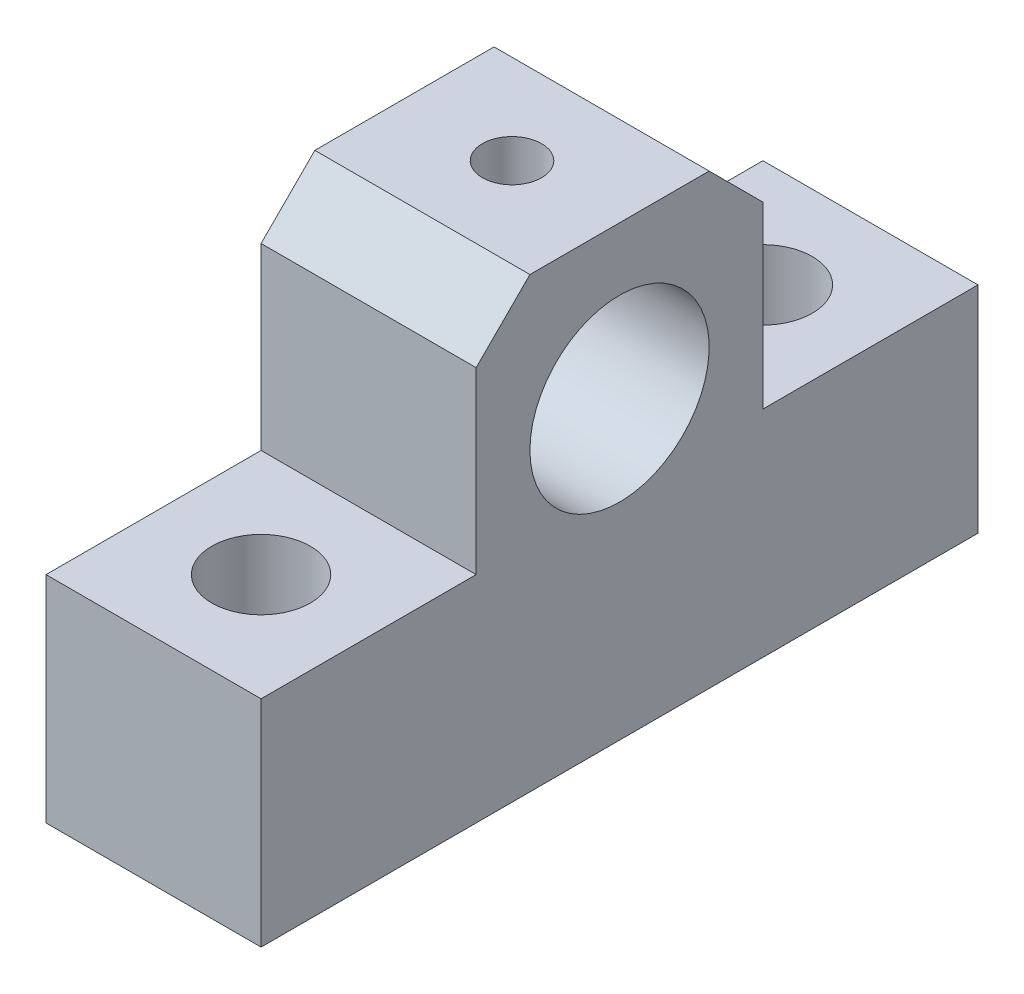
ISO-10303-21;
HEADER;
FILE_DESCRIPTION(('STEP AP214'),'2;1');
FILE_NAME('part.step','',(''),(''),'','','');
FILE_SCHEMA(('AUTOMOTIVE_DESIGN { 1 0 10303 214 1 1 1 1 }'));
ENDSEC;
DATA;
#1=APPLICATION_CONTEXT('core data for automotive mechanical design processes');
#2=APPLICATION_PROTOCOL_DEFINITION('international standard','automotive_design',2000,#1);
#3=PRODUCT_CONTEXT('',#1,'mechanical');
#4=PRODUCT('Part','Part','',(#3));
#5=PRODUCT_RELATED_PRODUCT_CATEGORY('part','',(#4));
#6=PRODUCT_DEFINITION_FORMATION('','',#4);
#7=PRODUCT_DEFINITION_CONTEXT('part definition',#1,'design');
#8=PRODUCT_DEFINITION('design','',#6,#7);
#9=PRODUCT_DEFINITION_SHAPE('','',#8);
#10=(LENGTH_UNIT() NAMED_UNIT(*) SI_UNIT(.MILLI.,.METRE.));
#11=(NAMED_UNIT(*) PLANE_ANGLE_UNIT() SI_UNIT($,.RADIAN.));
#12=(NAMED_UNIT(*) SI_UNIT($,.STERADIAN.) SOLID_ANGLE_UNIT());
#13=UNCERTAINTY_MEASURE_WITH_UNIT(LENGTH_MEASURE(1.E-05),#10,'distance_accuracy_value','');
#14=(GEOMETRIC_REPRESENTATION_CONTEXT(3) GLOBAL_UNCERTAINTY_ASSIGNED_CONTEXT((#13)) GLOBAL_UNIT_ASSIGNED_CONTEXT((#10,
#11,#12)) REPRESENTATION_CONTEXT('',''));
#15=CARTESIAN_POINT('',(0.,0.,0.));
#16=DIRECTION('',(0.,0.,1.));
#17=DIRECTION('',(1.,0.,0.));
#18=AXIS2_PLACEMENT_3D('',#15,#16,#17);
#19=CARTESIAN_POINT('',(6.,-12.5,14.));
#20=DIRECTION('',(0.,1.,0.));
#21=DIRECTION('',(0.,0.,1.));
#22=AXIS2_PLACEMENT_3D('',#19,#20,#21);
#23=CYLINDRICAL_SURFACE('',#22,2.75);
#24=CARTESIAN_POINT('',(6.,-12.5,14.));
#25=DIRECTION('',(0.,1.,0.));
#26=DIRECTION('',(0.,0.,1.));
#27=AXIS2_PLACEMENT_3D('',#24,#25,#26);
#28=CIRCLE('',#27,2.75);
#29=CARTESIAN_POINT('',(6.,-12.5,16.75));
#30=VERTEX_POINT('',#29);
#31=EDGE_CURVE('E239',#30,#30,#28,.F.);
#32=ORIENTED_EDGE('',*,*,#31,.T.);
#33=EDGE_LOOP('',(#32));
#34=FACE_BOUND('',#33,.T.);
#35=CARTESIAN_POINT('',(6.,-0.499999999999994,14.));
#36=DIRECTION('',(0.,1.,0.));
#37=DIRECTION('',(0.,0.,1.));
#38=AXIS2_PLACEMENT_3D('',#35,#36,#37);
#39=CIRCLE('',#38,2.75);
#40=CARTESIAN_POINT('',(6.,-0.499999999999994,16.75));
#41=VERTEX_POINT('',#40);
#42=EDGE_CURVE('E246',#41,#41,#39,.T.);
#43=ORIENTED_EDGE('',*,*,#42,.T.);
#44=EDGE_LOOP('',(#43));
#45=FACE_BOUND('',#44,.T.);
#46=ADVANCED_FACE('F17',(#34,#45),#23,.F.);
#47=CARTESIAN_POINT('',(6.,-12.5,-14.));
#48=DIRECTION('',(0.,1.,0.));
#49=DIRECTION('',(0.,0.,1.));
#50=AXIS2_PLACEMENT_3D('',#47,#48,#49);
#51=CYLINDRICAL_SURFACE('',#50,2.75);
#52=CARTESIAN_POINT('',(6.,-12.5,-14.));
#53=DIRECTION('',(0.,1.,0.));
#54=DIRECTION('',(0.,0.,1.));
#55=AXIS2_PLACEMENT_3D('',#52,#53,#54);
#56=CIRCLE('',#55,2.75);
#57=CARTESIAN_POINT('',(6.,-12.5,-11.25));
#58=VERTEX_POINT('',#57);
#59=EDGE_CURVE('E236',#58,#58,#56,.F.);
#60=ORIENTED_EDGE('',*,*,#59,.T.);
#61=EDGE_LOOP('',(#60));
#62=FACE_BOUND('',#61,.T.);
#63=CARTESIAN_POINT('',(6.,-0.49999999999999,-14.));
#64=DIRECTION('',(0.,1.,0.));
#65=DIRECTION('',(0.,0.,1.));
#66=AXIS2_PLACEMENT_3D('',#63,#64,#65);
#67=CIRCLE('',#66,2.75);
#68=CARTESIAN_POINT('',(6.,-0.49999999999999,-11.25));
#69=VERTEX_POINT('',#68);
#70=EDGE_CURVE('E225',#69,#69,#67,.T.);
#71=ORIENTED_EDGE('',*,*,#70,.T.);
#72=EDGE_LOOP('',(#71));
#73=FACE_BOUND('',#72,.T.);
#74=ADVANCED_FACE('F259',(#62,#73),#51,.F.);
#75=CARTESIAN_POINT('',(0.,0.,0.));
#76=DIRECTION('',(1.,0.,0.));
#77=DIRECTION('',(0.,0.,-1.));
#78=AXIS2_PLACEMENT_3D('',#75,#76,#77);
#79=PLANE('',#78);
#80=CARTESIAN_POINT('',(0.,3.99999999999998,0.));
#81=DIRECTION('',(-1.,0.,0.));
#82=DIRECTION('',(0.,0.,1.));
#83=AXIS2_PLACEMENT_3D('',#80,#81,#82);
#84=CIRCLE('',#83,5.);
#85=CARTESIAN_POINT('',(0.,3.99999999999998,5.));
#86=VERTEX_POINT('',#85);
#87=EDGE_CURVE('E127',#86,#86,#84,.F.);
#88=ORIENTED_EDGE('',*,*,#87,.T.);
#89=EDGE_LOOP('',(#88));
#90=FACE_BOUND('',#89,.T.);
#91=DIRECTION('',(0.,0.707106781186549,-0.707106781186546));
#92=VECTOR('',#91,1.);
#93=CARTESIAN_POINT('',(0.,12.5,4.99999999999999));
#94=LINE('',#93,#92);
#95=CARTESIAN_POINT('',(0.,9.49999999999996,8.));
#96=VERTEX_POINT('',#95);
#97=CARTESIAN_POINT('',(0.,12.5,4.99999999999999));
#98=VERTEX_POINT('',#97);
#99=EDGE_CURVE('E107',#96,#98,#94,.T.);
#100=ORIENTED_EDGE('',*,*,#99,.T.);
#101=DIRECTION('',(0.,0.,-1.));
#102=VECTOR('',#101,1.);
#103=CARTESIAN_POINT('',(0.,12.5,20.));
#104=LINE('',#103,#102);
#105=CARTESIAN_POINT('',(0.,12.5,-4.99999999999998));
#106=VERTEX_POINT('',#105);
#107=EDGE_CURVE('E96',#98,#106,#104,.T.);
#108=ORIENTED_EDGE('',*,*,#107,.T.);
#109=DIRECTION('',(0.,-0.707106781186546,-0.707106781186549));
#110=VECTOR('',#109,1.);
#111=CARTESIAN_POINT('',(0.,9.49999999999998,-8.00000000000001));
#112=LINE('',#111,#110);
#113=CARTESIAN_POINT('',(0.,9.49999999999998,-8.00000000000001));
#114=VERTEX_POINT('',#113);
#115=EDGE_CURVE('E212',#106,#114,#112,.T.);
#116=ORIENTED_EDGE('',*,*,#115,.T.);
#117=DIRECTION('',(0.,1.,0.));
#118=VECTOR('',#117,1.);
#119=CARTESIAN_POINT('',(0.,12.5,-8.00000000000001));
#120=LINE('',#119,#118);
#121=CARTESIAN_POINT('',(0.,-0.499999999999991,-8.00000000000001));
#122=VERTEX_POINT('',#121);
#123=EDGE_CURVE('E216',#114,#122,#120,.F.);
#124=ORIENTED_EDGE('',*,*,#123,.T.);
#125=DIRECTION('',(0.,0.,-1.));
#126=VECTOR('',#125,1.);
#127=CARTESIAN_POINT('',(0.,-0.499999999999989,-20.));
#128=LINE('',#127,#126);
#129=CARTESIAN_POINT('',(0.,-0.49999999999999,-20.));
#130=VERTEX_POINT('',#129);
#131=EDGE_CURVE('E223',#122,#130,#128,.T.);
#132=ORIENTED_EDGE('',*,*,#131,.T.);
#133=DIRECTION('',(0.,-1.,0.));
#134=VECTOR('',#133,1.);
#135=CARTESIAN_POINT('',(0.,12.5,-20.));
#136=LINE('',#135,#134);
#137=CARTESIAN_POINT('',(0.,-12.5,-20.));
#138=VERTEX_POINT('',#137);
#139=EDGE_CURVE('E226',#130,#138,#136,.T.);
#140=ORIENTED_EDGE('',*,*,#139,.T.);
#141=DIRECTION('',(0.,0.,1.));
#142=VECTOR('',#141,1.);
#143=CARTESIAN_POINT('',(0.,-12.5,20.));
#144=LINE('',#143,#142);
#145=CARTESIAN_POINT('',(0.,-12.5,20.));
#146=VERTEX_POINT('',#145);
#147=EDGE_CURVE('E231',#138,#146,#144,.T.);
#148=ORIENTED_EDGE('',*,*,#147,.T.);
#149=DIRECTION('',(0.,1.,0.));
#150=VECTOR('',#149,1.);
#151=CARTESIAN_POINT('',(0.,12.5,20.));
#152=LINE('',#151,#150);
#153=CARTESIAN_POINT('',(0.,-0.499999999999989,20.));
#154=VERTEX_POINT('',#153);
#155=EDGE_CURVE('E240',#146,#154,#152,.T.);
#156=ORIENTED_EDGE('',*,*,#155,.T.);
#157=DIRECTION('',(0.,0.,-1.));
#158=VECTOR('',#157,1.);
#159=CARTESIAN_POINT('',(0.,-0.49999999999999,20.));
#160=LINE('',#159,#158);
#161=CARTESIAN_POINT('',(0.,-0.49999999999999,8.));
#162=VERTEX_POINT('',#161);
#163=EDGE_CURVE('E244',#154,#162,#160,.T.);
#164=ORIENTED_EDGE('',*,*,#163,.T.);
#165=DIRECTION('',(0.,1.,0.));
#166=VECTOR('',#165,1.);
#167=CARTESIAN_POINT('',(0.,12.5,8.));
#168=LINE('',#167,#166);
#169=EDGE_CURVE('E91',#162,#96,#168,.T.);
#170=ORIENTED_EDGE('',*,*,#169,.T.);
#171=EDGE_LOOP('',(#100,#108,#116,#124,#132,#140,#148,#156,#164,#170));
#172=FACE_BOUND('',#171,.T.);
#173=ADVANCED_FACE('F108',(#90,#172),#79,.F.);
#174=CARTESIAN_POINT('',(6.,12.5,0.));
#175=DIRECTION('',(0.,1.,0.));
#176=DIRECTION('',(0.,0.,1.));
#177=AXIS2_PLACEMENT_3D('',#174,#175,#176);
#178=CYLINDRICAL_SURFACE('',#177,1.64999999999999);
#179=CARTESIAN_POINT('',(6.,12.5,0.));
#180=DIRECTION('',(0.,1.,0.));
#181=DIRECTION('',(0.,0.,1.));
#182=AXIS2_PLACEMENT_3D('',#179,#180,#181);
#183=CIRCLE('',#182,1.64999999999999);
#184=CARTESIAN_POINT('',(6.,12.5,1.64999999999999));
#185=VERTEX_POINT('',#184);
#186=EDGE_CURVE('E20',#185,#185,#183,.T.);
#187=ORIENTED_EDGE('',*,*,#186,.T.);
#188=EDGE_LOOP('',(#187));
#189=FACE_BOUND('',#188,.T.);
#190=CARTESIAN_POINT('',(6.,8.71990466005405,1.64999999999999));
#191=CARTESIAN_POINT('',(5.910194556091,8.7199090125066,1.64999483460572));
#192=CARTESIAN_POINT('',(5.82029507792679,8.72250006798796,1.64263299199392));
#193=CARTESIAN_POINT('',(5.64306551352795,8.73255052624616,1.61344105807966));
#194=CARTESIAN_POINT('',(5.55574008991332,8.74001825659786,1.59158621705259));
#195=CARTESIAN_POINT('',(5.38639090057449,8.75888098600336,1.53425978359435));
#196=CARTESIAN_POINT('',(5.30435428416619,8.77026600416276,1.49882277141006));
#197=CARTESIAN_POINT('',(5.14739402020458,8.79566747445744,1.41543814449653));
#198=CARTESIAN_POINT('',(5.07246967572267,8.80968366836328,1.36749175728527));
#199=CARTESIAN_POINT('',(4.92894453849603,8.83937529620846,1.2584679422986));
#200=CARTESIAN_POINT('',(4.86065609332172,8.85509158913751,1.1969903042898));
#201=CARTESIAN_POINT('',(4.73514357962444,8.88606743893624,1.06350096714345));
#202=CARTESIAN_POINT('',(4.6779218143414,8.90132690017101,0.991487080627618));
#203=CARTESIAN_POINT('',(4.57476631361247,8.93013894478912,0.836704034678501));
#204=CARTESIAN_POINT('',(4.52915749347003,8.94363810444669,0.753707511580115));
#205=CARTESIAN_POINT('',(4.4526711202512,8.96692991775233,0.580699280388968));
#206=CARTESIAN_POINT('',(4.42178961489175,8.97672356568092,0.490689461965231));
#207=CARTESIAN_POINT('',(4.37668693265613,8.99121262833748,0.309471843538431));
#208=CARTESIAN_POINT('',(4.36193278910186,8.99607073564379,0.218409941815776));
#209=CARTESIAN_POINT('',(4.34781000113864,9.00071837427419,0.0349820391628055));
#210=CARTESIAN_POINT('',(4.3484374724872,9.00050918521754,-0.0573836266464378));
#211=CARTESIAN_POINT('',(4.36471995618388,8.99515655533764,-0.237027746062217));
#212=CARTESIAN_POINT('',(4.37979619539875,8.99020315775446,-0.324365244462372));
#213=CARTESIAN_POINT('',(4.4235924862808,8.97615645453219,-0.495193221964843));
#214=CARTESIAN_POINT('',(4.45231351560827,8.96706285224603,-0.578683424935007));
#215=CARTESIAN_POINT('',(4.52292829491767,8.94551310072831,-0.74072525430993));
#216=CARTESIAN_POINT('',(4.56498882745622,8.93301467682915,-0.819198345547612));
#217=CARTESIAN_POINT('',(4.66094960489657,8.90595974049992,-0.96814113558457));
#218=CARTESIAN_POINT('',(4.71485247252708,8.89140277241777,-1.0386090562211));
#219=CARTESIAN_POINT('',(4.83588432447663,8.86097559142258,-1.17298002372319));
#220=CARTESIAN_POINT('',(4.90350806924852,8.8450757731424,-1.23643131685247));
#221=CARTESIAN_POINT('',(5.04860129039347,8.81431634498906,-1.35125953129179));
#222=CARTESIAN_POINT('',(5.12607555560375,8.79945724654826,-1.40263054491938));
#223=CARTESIAN_POINT('',(5.29010127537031,8.77229779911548,-1.49245253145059));
#224=CARTESIAN_POINT('',(5.37676757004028,8.7600374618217,-1.53070639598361));
#225=CARTESIAN_POINT('',(5.55572410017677,8.73994010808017,-1.59186083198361));
#226=CARTESIAN_POINT('',(5.6480019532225,8.7320937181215,-1.61479395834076));
#227=CARTESIAN_POINT('',(5.78428531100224,8.72463721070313,-1.6364118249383));
#228=CARTESIAN_POINT('',(5.8272439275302,8.72286858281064,-1.64150096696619));
#229=CARTESIAN_POINT('',(5.91346108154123,8.72050125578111,-1.64829630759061));
#230=CARTESIAN_POINT('',(5.95671962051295,8.71990256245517,-1.65000248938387));
#231=CARTESIAN_POINT('',(6.089805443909,8.7199090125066,-1.64999483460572));
#232=CARTESIAN_POINT('',(6.17970492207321,8.72250006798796,-1.64263299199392));
#233=CARTESIAN_POINT('',(6.35693448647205,8.73255052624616,-1.61344105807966));
#234=CARTESIAN_POINT('',(6.44425991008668,8.74001825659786,-1.59158621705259));
#235=CARTESIAN_POINT('',(6.61360909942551,8.75888098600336,-1.53425978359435));
#236=CARTESIAN_POINT('',(6.69564571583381,8.77026600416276,-1.49882277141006));
#237=CARTESIAN_POINT('',(6.85260597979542,8.79566747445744,-1.41543814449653));
#238=CARTESIAN_POINT('',(6.92753032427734,8.80968366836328,-1.36749175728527));
#239=CARTESIAN_POINT('',(7.07105546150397,8.83937529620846,-1.2584679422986));
#240=CARTESIAN_POINT('',(7.13934390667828,8.85509158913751,-1.1969903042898));
#241=CARTESIAN_POINT('',(7.26485642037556,8.88606743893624,-1.06350096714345));
#242=CARTESIAN_POINT('',(7.3220781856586,8.90132690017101,-0.991487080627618));
#243=CARTESIAN_POINT('',(7.42523368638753,8.93013894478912,-0.836704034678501));
#244=CARTESIAN_POINT('',(7.47084250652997,8.94363810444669,-0.753707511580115));
#245=CARTESIAN_POINT('',(7.5473288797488,8.96692991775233,-0.580699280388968));
#246=CARTESIAN_POINT('',(7.57821038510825,8.97672356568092,-0.490689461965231));
#247=CARTESIAN_POINT('',(7.62331306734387,8.99121262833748,-0.309471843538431));
#248=CARTESIAN_POINT('',(7.63806721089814,8.99607073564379,-0.218409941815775));
#249=CARTESIAN_POINT('',(7.65218999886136,9.00071837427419,-0.0349820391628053));
#250=CARTESIAN_POINT('',(7.6515625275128,9.00050918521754,0.0573836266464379));
#251=CARTESIAN_POINT('',(7.63528004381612,8.99515655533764,0.237027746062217));
#252=CARTESIAN_POINT('',(7.62020380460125,8.99020315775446,0.324365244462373));
#253=CARTESIAN_POINT('',(7.5764075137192,8.97615645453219,0.495193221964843));
#254=CARTESIAN_POINT('',(7.54768648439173,8.96706285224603,0.578683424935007));
#255=CARTESIAN_POINT('',(7.47707170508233,8.94551310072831,0.74072525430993));
#256=CARTESIAN_POINT('',(7.43501117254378,8.93301467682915,0.819198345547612));
#257=CARTESIAN_POINT('',(7.33905039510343,8.90595974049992,0.96814113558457));
#258=CARTESIAN_POINT('',(7.28514752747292,8.89140277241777,1.0386090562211));
#259=CARTESIAN_POINT('',(7.16411567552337,8.86097559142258,1.17298002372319));
#260=CARTESIAN_POINT('',(7.09649193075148,8.8450757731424,1.23643131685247));
#261=CARTESIAN_POINT('',(6.95139870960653,8.81431634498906,1.35125953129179));
#262=CARTESIAN_POINT('',(6.87392444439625,8.79945724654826,1.40263054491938));
#263=CARTESIAN_POINT('',(6.70989872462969,8.77229779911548,1.49245253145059));
#264=CARTESIAN_POINT('',(6.62323242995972,8.7600374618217,1.53070639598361));
#265=CARTESIAN_POINT('',(6.44427589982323,8.73994010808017,1.59186083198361));
#266=CARTESIAN_POINT('',(6.3519980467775,8.7320937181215,1.61479395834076));
#267=CARTESIAN_POINT('',(6.21571468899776,8.72463721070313,1.6364118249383));
#268=CARTESIAN_POINT('',(6.1727560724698,8.72286858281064,1.64150096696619));
#269=CARTESIAN_POINT('',(6.08653891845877,8.72050125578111,1.64829630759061));
#270=CARTESIAN_POINT('',(6.04328037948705,8.71990256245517,1.65000248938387));
#271=CARTESIAN_POINT('',(6.,8.71990466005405,1.64999999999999));
#272=B_SPLINE_CURVE_WITH_KNOTS('',3,(#190,#191,#192,#193,#194,#195,#196,#197,#198,#199,#200,
#201,#202,#203,#204,#205,#206,#207,#208,#209,#210,#211,#212,#213,#214,#215,#216,#217,#218,#219,
#220,#221,#222,#223,#224,#225,#226,#227,#228,#229,#230,#231,#232,#233,#234,#235,#236,#237,#238,
#239,#240,#241,#242,#243,#244,#245,#246,#247,#248,#249,#250,#251,#252,#253,#254,#255,#256,#257,
#258,#259,#260,#261,#262,#263,#264,#265,#266,#267,#268,#269,#270,#271),.UNSPECIFIED.,.T.,.F.,(4,
2,2,2,2,2,2,2,2,2,2,2,2,2,2,2,2,2,2,2,2,2,2,2,2,2,2,2,2,2,2,2,2,2,2,2,2,2,2,2,4),(0.,
0.269248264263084,0.538957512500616,0.80798459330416,1.07698528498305,1.35538334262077,
1.63383927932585,1.91939313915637,2.20487032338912,2.48059785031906,2.75625574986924,
3.02131393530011,3.28639111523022,3.55492264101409,3.82351369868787,4.10447351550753,
4.38557044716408,4.6707231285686,4.95526794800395,5.08502744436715,5.21478758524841,
5.48403584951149,5.75374509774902,6.02277217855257,6.29177287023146,6.57017092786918,
6.84862686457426,7.13418072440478,7.41965790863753,7.69538543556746,7.97104333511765,
8.23610152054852,8.50117870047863,8.7697102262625,9.03830128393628,9.31926110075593,
9.60035803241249,9.885510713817,10.1700555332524,10.2998150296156,10.4295751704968),.UNSPECIFIED.);
#273=CARTESIAN_POINT('',(6.,8.71990466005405,1.64999999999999));
#274=VERTEX_POINT('',#273);
#275=EDGE_CURVE('E119',#274,#274,#272,.T.);
#276=ORIENTED_EDGE('',*,*,#275,.T.);
#277=EDGE_LOOP('',(#276));
#278=FACE_BOUND('',#277,.T.);
#279=ADVANCED_FACE('F129',(#189,#278),#178,.F.);
#280=CARTESIAN_POINT('',(12.,12.5,20.));
#281=DIRECTION('',(0.,-1.,0.));
#282=DIRECTION('',(0.,0.,-1.));
#283=AXIS2_PLACEMENT_3D('',#280,#281,#282);
#284=PLANE('',#283);
#285=DIRECTION('',(1.,0.,0.));
#286=VECTOR('',#285,1.);
#287=CARTESIAN_POINT('',(12.,12.5,4.99999999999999));
#288=LINE('',#287,#286);
#289=CARTESIAN_POINT('',(12.,12.5,4.99999999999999));
#290=VERTEX_POINT('',#289);
#291=EDGE_CURVE('E100',#98,#290,#288,.T.);
#292=ORIENTED_EDGE('',*,*,#291,.T.);
#293=DIRECTION('',(0.,0.,-1.));
#294=VECTOR('',#293,1.);
#295=CARTESIAN_POINT('',(12.,12.5,0.));
#296=LINE('',#295,#294);
#297=CARTESIAN_POINT('',(12.,12.5,-4.99999999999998));
#298=VERTEX_POINT('',#297);
#299=EDGE_CURVE('E126',#298,#290,#296,.F.);
#300=ORIENTED_EDGE('',*,*,#299,.F.);
#301=DIRECTION('',(1.,0.,0.));
#302=VECTOR('',#301,1.);
#303=CARTESIAN_POINT('',(0.,12.5,-4.99999999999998));
#304=LINE('',#303,#302);
#305=EDGE_CURVE('E103',#298,#106,#304,.F.);
#306=ORIENTED_EDGE('',*,*,#305,.T.);
#307=ORIENTED_EDGE('',*,*,#107,.F.);
#308=EDGE_LOOP('',(#292,#300,#306,#307));
#309=FACE_BOUND('',#308,.T.);
#310=ORIENTED_EDGE('',*,*,#186,.F.);
#311=EDGE_LOOP('',(#310));
#312=FACE_BOUND('',#311,.T.);
#313=ADVANCED_FACE('F97',(#309,#312),#284,.F.);
#314=CARTESIAN_POINT('',(12.,12.5,4.99999999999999));
#315=DIRECTION('',(0.,-0.707106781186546,-0.707106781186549));
#316=DIRECTION('',(0.,0.707106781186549,-0.707106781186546));
#317=AXIS2_PLACEMENT_3D('',#314,#315,#316);
#318=PLANE('',#317);
#319=DIRECTION('',(-1.,0.,0.));
#320=VECTOR('',#319,1.);
#321=CARTESIAN_POINT('',(0.,9.49999999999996,8.));
#322=LINE('',#321,#320);
#323=CARTESIAN_POINT('',(12.,9.49999999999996,8.));
#324=VERTEX_POINT('',#323);
#325=EDGE_CURVE('E247',#96,#324,#322,.F.);
#326=ORIENTED_EDGE('',*,*,#325,.T.);
#327=DIRECTION('',(0.,-0.707106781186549,0.707106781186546));
#328=VECTOR('',#327,1.);
#329=CARTESIAN_POINT('',(12.,12.5,4.99999999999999));
#330=LINE('',#329,#328);
#331=EDGE_CURVE('E114',#290,#324,#330,.T.);
#332=ORIENTED_EDGE('',*,*,#331,.F.);
#333=ORIENTED_EDGE('',*,*,#291,.F.);
#334=ORIENTED_EDGE('',*,*,#99,.F.);
#335=EDGE_LOOP('',(#326,#332,#333,#334));
#336=FACE_BOUND('',#335,.T.);
#337=ADVANCED_FACE('F112',(#336),#318,.F.);
#338=CARTESIAN_POINT('',(0.,12.5,8.));
#339=DIRECTION('',(0.,0.,-1.));
#340=DIRECTION('',(-1.,0.,0.));
#341=AXIS2_PLACEMENT_3D('',#338,#339,#340);
#342=PLANE('',#341);
#343=ORIENTED_EDGE('',*,*,#325,.F.);
#344=ORIENTED_EDGE('',*,*,#169,.F.);
#345=DIRECTION('',(1.,0.,0.));
#346=VECTOR('',#345,1.);
#347=CARTESIAN_POINT('',(0.,-0.49999999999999,8.));
#348=LINE('',#347,#346);
#349=CARTESIAN_POINT('',(12.,-0.49999999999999,8.));
#350=VERTEX_POINT('',#349);
#351=EDGE_CURVE('E242',#162,#350,#348,.T.);
#352=ORIENTED_EDGE('',*,*,#351,.T.);
#353=DIRECTION('',(0.,1.,0.));
#354=VECTOR('',#353,1.);
#355=CARTESIAN_POINT('',(12.,0.,8.));
#356=LINE('',#355,#354);
#357=EDGE_CURVE('E207',#324,#350,#356,.F.);
#358=ORIENTED_EDGE('',*,*,#357,.F.);
#359=EDGE_LOOP('',(#343,#344,#352,#358));
#360=FACE_BOUND('',#359,.T.);
#361=ADVANCED_FACE('F166',(#360),#342,.F.);
#362=CARTESIAN_POINT('',(0.,-0.49999999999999,20.));
#363=DIRECTION('',(0.,-1.,0.));
#364=DIRECTION('',(0.,0.,-1.));
#365=AXIS2_PLACEMENT_3D('',#362,#363,#364);
#366=PLANE('',#365);
#367=ORIENTED_EDGE('',*,*,#351,.F.);
#368=ORIENTED_EDGE('',*,*,#163,.F.);
#369=DIRECTION('',(1.,0.,0.));
#370=VECTOR('',#369,1.);
#371=CARTESIAN_POINT('',(12.,-0.499999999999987,20.));
#372=LINE('',#371,#370);
#373=CARTESIAN_POINT('',(12.,-0.499999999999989,20.));
#374=VERTEX_POINT('',#373);
#375=EDGE_CURVE('E237',#154,#374,#372,.T.);
#376=ORIENTED_EDGE('',*,*,#375,.T.);
#377=DIRECTION('',(0.,0.,-1.));
#378=VECTOR('',#377,1.);
#379=CARTESIAN_POINT('',(12.,-0.49999999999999,0.));
#380=LINE('',#379,#378);
#381=EDGE_CURVE('E204',#350,#374,#380,.F.);
#382=ORIENTED_EDGE('',*,*,#381,.F.);
#383=EDGE_LOOP('',(#367,#368,#376,#382));
#384=FACE_BOUND('',#383,.T.);
#385=ORIENTED_EDGE('',*,*,#42,.F.);
#386=EDGE_LOOP('',(#385));
#387=FACE_BOUND('',#386,.T.);
#388=ADVANCED_FACE('F162',(#384,#387),#366,.F.);
#389=CARTESIAN_POINT('',(12.,12.5,20.));
#390=DIRECTION('',(0.,0.,-1.));
#391=DIRECTION('',(0.,1.,0.));
#392=AXIS2_PLACEMENT_3D('',#389,#390,#391);
#393=PLANE('',#392);
#394=ORIENTED_EDGE('',*,*,#375,.F.);
#395=ORIENTED_EDGE('',*,*,#155,.F.);
#396=DIRECTION('',(1.,0.,0.));
#397=VECTOR('',#396,1.);
#398=CARTESIAN_POINT('',(12.,-12.5,20.));
#399=LINE('',#398,#397);
#400=CARTESIAN_POINT('',(12.,-12.5,20.));
#401=VERTEX_POINT('',#400);
#402=EDGE_CURVE('E234',#146,#401,#399,.T.);
#403=ORIENTED_EDGE('',*,*,#402,.T.);
#404=DIRECTION('',(0.,1.,0.));
#405=VECTOR('',#404,1.);
#406=CARTESIAN_POINT('',(12.,0.,20.));
#407=LINE('',#406,#405);
#408=EDGE_CURVE('E201',#374,#401,#407,.F.);
#409=ORIENTED_EDGE('',*,*,#408,.F.);
#410=EDGE_LOOP('',(#394,#395,#403,#409));
#411=FACE_BOUND('',#410,.T.);
#412=ADVANCED_FACE('F158',(#411),#393,.F.);
#413=CARTESIAN_POINT('',(12.,-12.5,20.));
#414=DIRECTION('',(0.,1.,0.));
#415=DIRECTION('',(0.,0.,1.));
#416=AXIS2_PLACEMENT_3D('',#413,#414,#415);
#417=PLANE('',#416);
#418=DIRECTION('',(1.,0.,0.));
#419=VECTOR('',#418,1.);
#420=CARTESIAN_POINT('',(12.,-12.5,-20.));
#421=LINE('',#420,#419);
#422=CARTESIAN_POINT('',(12.,-12.5,-20.));
#423=VERTEX_POINT('',#422);
#424=EDGE_CURVE('E229',#138,#423,#421,.T.);
#425=ORIENTED_EDGE('',*,*,#424,.T.);
#426=DIRECTION('',(0.,0.,-1.));
#427=VECTOR('',#426,1.);
#428=CARTESIAN_POINT('',(12.,-12.5,0.));
#429=LINE('',#428,#427);
#430=EDGE_CURVE('E198',#401,#423,#429,.T.);
#431=ORIENTED_EDGE('',*,*,#430,.F.);
#432=ORIENTED_EDGE('',*,*,#402,.F.);
#433=ORIENTED_EDGE('',*,*,#147,.F.);
#434=EDGE_LOOP('',(#425,#431,#432,#433));
#435=FACE_BOUND('',#434,.T.);
#436=ORIENTED_EDGE('',*,*,#59,.F.);
#437=EDGE_LOOP('',(#436));
#438=FACE_BOUND('',#437,.T.);
#439=ORIENTED_EDGE('',*,*,#31,.F.);
#440=EDGE_LOOP('',(#439));
#441=FACE_BOUND('',#440,.T.);
#442=ADVANCED_FACE('F154',(#435,#438,#441),#417,.F.);
#443=CARTESIAN_POINT('',(12.,12.5,-20.));
#444=DIRECTION('',(0.,0.,1.));
#445=DIRECTION('',(0.,-1.,0.));
#446=AXIS2_PLACEMENT_3D('',#443,#444,#445);
#447=PLANE('',#446);
#448=DIRECTION('',(1.,0.,0.));
#449=VECTOR('',#448,1.);
#450=CARTESIAN_POINT('',(0.,-0.499999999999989,-20.));
#451=LINE('',#450,#449);
#452=CARTESIAN_POINT('',(12.,-0.49999999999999,-20.));
#453=VERTEX_POINT('',#452);
#454=EDGE_CURVE('E221',#130,#453,#451,.T.);
#455=ORIENTED_EDGE('',*,*,#454,.T.);
#456=DIRECTION('',(0.,1.,0.));
#457=VECTOR('',#456,1.);
#458=CARTESIAN_POINT('',(12.,0.,-20.));
#459=LINE('',#458,#457);
#460=EDGE_CURVE('E194',#423,#453,#459,.T.);
#461=ORIENTED_EDGE('',*,*,#460,.F.);
#462=ORIENTED_EDGE('',*,*,#424,.F.);
#463=ORIENTED_EDGE('',*,*,#139,.F.);
#464=EDGE_LOOP('',(#455,#461,#462,#463));
#465=FACE_BOUND('',#464,.T.);
#466=ADVANCED_FACE('F150',(#465),#447,.F.);
#467=CARTESIAN_POINT('',(0.,-0.499999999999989,-20.));
#468=DIRECTION('',(0.,-1.,0.));
#469=DIRECTION('',(0.,0.,-1.));
#470=AXIS2_PLACEMENT_3D('',#467,#468,#469);
#471=PLANE('',#470);
#472=ORIENTED_EDGE('',*,*,#454,.F.);
#473=ORIENTED_EDGE('',*,*,#131,.F.);
#474=DIRECTION('',(1.,0.,0.));
#475=VECTOR('',#474,1.);
#476=CARTESIAN_POINT('',(0.,-0.499999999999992,-8.00000000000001));
#477=LINE('',#476,#475);
#478=CARTESIAN_POINT('',(12.,-0.499999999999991,-8.00000000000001));
#479=VERTEX_POINT('',#478);
#480=EDGE_CURVE('E219',#122,#479,#477,.T.);
#481=ORIENTED_EDGE('',*,*,#480,.T.);
#482=DIRECTION('',(0.,0.,-1.));
#483=VECTOR('',#482,1.);
#484=CARTESIAN_POINT('',(12.,-0.499999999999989,0.));
#485=LINE('',#484,#483);
#486=EDGE_CURVE('E190',#453,#479,#485,.F.);
#487=ORIENTED_EDGE('',*,*,#486,.F.);
#488=EDGE_LOOP('',(#472,#473,#481,#487));
#489=FACE_BOUND('',#488,.T.);
#490=ORIENTED_EDGE('',*,*,#70,.F.);
#491=EDGE_LOOP('',(#490));
#492=FACE_BOUND('',#491,.T.);
#493=ADVANCED_FACE('F147',(#489,#492),#471,.F.);
#494=CARTESIAN_POINT('',(0.,12.5,-8.00000000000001));
#495=DIRECTION('',(0.,0.,1.));
#496=DIRECTION('',(1.,0.,0.));
#497=AXIS2_PLACEMENT_3D('',#494,#495,#496);
#498=PLANE('',#497);
#499=DIRECTION('',(1.,0.,0.));
#500=VECTOR('',#499,1.);
#501=CARTESIAN_POINT('',(0.,9.49999999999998,-8.00000000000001));
#502=LINE('',#501,#500);
#503=CARTESIAN_POINT('',(12.,9.49999999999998,-8.00000000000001));
#504=VERTEX_POINT('',#503);
#505=EDGE_CURVE('E35',#114,#504,#502,.T.);
#506=ORIENTED_EDGE('',*,*,#505,.T.);
#507=DIRECTION('',(0.,1.,0.));
#508=VECTOR('',#507,1.);
#509=CARTESIAN_POINT('',(12.,0.,-8.00000000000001));
#510=LINE('',#509,#508);
#511=EDGE_CURVE('E187',#479,#504,#510,.T.);
#512=ORIENTED_EDGE('',*,*,#511,.F.);
#513=ORIENTED_EDGE('',*,*,#480,.F.);
#514=ORIENTED_EDGE('',*,*,#123,.F.);
#515=EDGE_LOOP('',(#506,#512,#513,#514));
#516=FACE_BOUND('',#515,.T.);
#517=ADVANCED_FACE('F143',(#516),#498,.F.);
#518=CARTESIAN_POINT('',(0.,9.49999999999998,-8.00000000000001));
#519=DIRECTION('',(0.,-0.707106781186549,0.707106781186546));
#520=DIRECTION('',(0.,-0.707106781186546,-0.707106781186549));
#521=AXIS2_PLACEMENT_3D('',#518,#519,#520);
#522=PLANE('',#521);
#523=ORIENTED_EDGE('',*,*,#305,.F.);
#524=DIRECTION('',(0.,0.707106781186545,0.70710678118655));
#525=VECTOR('',#524,1.);
#526=CARTESIAN_POINT('',(12.,9.49999999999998,-8.00000000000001));
#527=LINE('',#526,#525);
#528=EDGE_CURVE('E26',#504,#298,#527,.T.);
#529=ORIENTED_EDGE('',*,*,#528,.F.);
#530=ORIENTED_EDGE('',*,*,#505,.F.);
#531=ORIENTED_EDGE('',*,*,#115,.F.);
#532=EDGE_LOOP('',(#523,#529,#530,#531));
#533=FACE_BOUND('',#532,.T.);
#534=ADVANCED_FACE('F139',(#533),#522,.F.);
#535=CARTESIAN_POINT('',(12.,3.99999999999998,0.));
#536=DIRECTION('',(-1.,0.,0.));
#537=DIRECTION('',(0.,0.,1.));
#538=AXIS2_PLACEMENT_3D('',#535,#536,#537);
#539=CYLINDRICAL_SURFACE('',#538,5.);
#540=CARTESIAN_POINT('',(12.,3.99999999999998,0.));
#541=DIRECTION('',(-1.,0.,0.));
#542=DIRECTION('',(0.,0.,1.));
#543=AXIS2_PLACEMENT_3D('',#540,#541,#542);
#544=CIRCLE('',#543,5.);
#545=CARTESIAN_POINT('',(12.,3.99999999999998,5.));
#546=VERTEX_POINT('',#545);
#547=EDGE_CURVE('E11',#546,#546,#544,.T.);
#548=ORIENTED_EDGE('',*,*,#547,.F.);
#549=EDGE_LOOP('',(#548));
#550=FACE_BOUND('',#549,.T.);
#551=ORIENTED_EDGE('',*,*,#275,.F.);
#552=EDGE_LOOP('',(#551));
#553=FACE_BOUND('',#552,.T.);
#554=ORIENTED_EDGE('',*,*,#87,.F.);
#555=EDGE_LOOP('',(#554));
#556=FACE_BOUND('',#555,.T.);
#557=ADVANCED_FACE('F133',(#550,#553,#556),#539,.F.);
#558=CARTESIAN_POINT('',(12.,0.,0.));
#559=DIRECTION('',(1.,0.,0.));
#560=DIRECTION('',(0.,0.,-1.));
#561=AXIS2_PLACEMENT_3D('',#558,#559,#560);
#562=PLANE('',#561);
#563=ORIENTED_EDGE('',*,*,#547,.T.);
#564=EDGE_LOOP('',(#563));
#565=FACE_BOUND('',#564,.T.);
#566=ORIENTED_EDGE('',*,*,#511,.T.);
#567=ORIENTED_EDGE('',*,*,#528,.T.);
#568=ORIENTED_EDGE('',*,*,#299,.T.);
#569=ORIENTED_EDGE('',*,*,#331,.T.);
#570=ORIENTED_EDGE('',*,*,#357,.T.);
#571=ORIENTED_EDGE('',*,*,#381,.T.);
#572=ORIENTED_EDGE('',*,*,#408,.T.);
#573=ORIENTED_EDGE('',*,*,#430,.T.);
#574=ORIENTED_EDGE('',*,*,#460,.T.);
#575=ORIENTED_EDGE('',*,*,#486,.T.);
#576=EDGE_LOOP('',(#566,#567,#568,#569,#570,#571,#572,#573,#574,#575));
#577=FACE_BOUND('',#576,.T.);
#578=ADVANCED_FACE('F138',(#565,#577),#562,.T.);
#579=CLOSED_SHELL('',(#46,#74,#173,#279,#313,#337,#361,#388,#412,#442,#466,#493,#517,#534,#557,#578));
#580=MANIFOLD_SOLID_BREP('B1',#579);
#581=ADVANCED_BREP_SHAPE_REPRESENTATION('',(#18,#580),#14);
#582=SHAPE_DEFINITION_REPRESENTATION(#9,#581);
ENDSEC;
END-ISO-10303-21;
